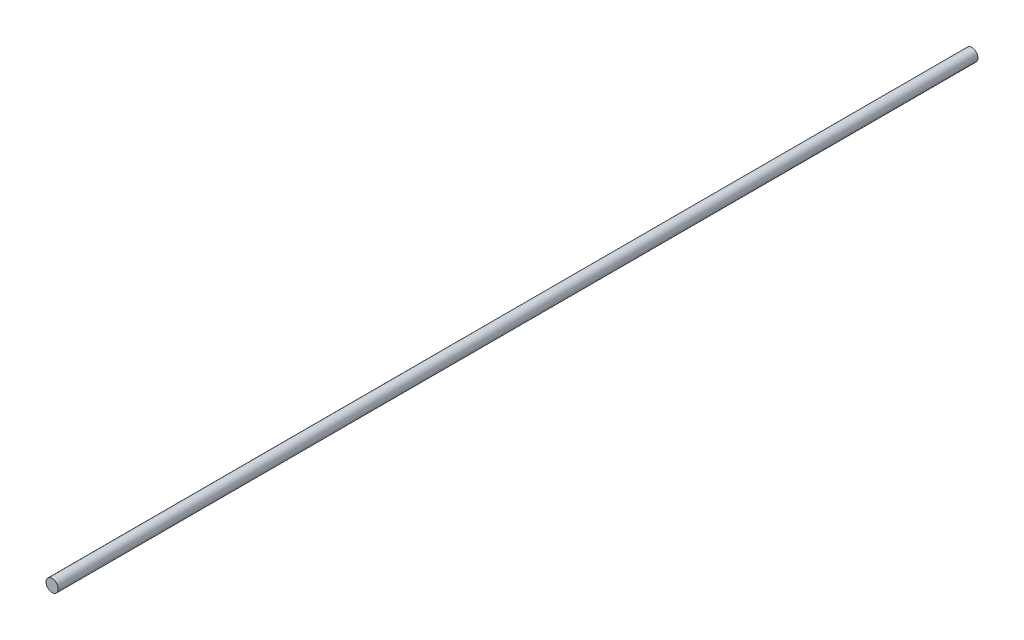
from build123d import *

# Parameters (mm, degrees)
SKETCH1_R           = 30
BOSS_EXTRUDE1_DEPTH = 4500


with BuildPart() as part:
    # Sketch1 → Boss-Extrude1 (new body)
    with BuildSketch(Plane.XY):
        Circle(SKETCH1_R)
    extrude(amount=-BOSS_EXTRUDE1_DEPTH)


solid = part.part
